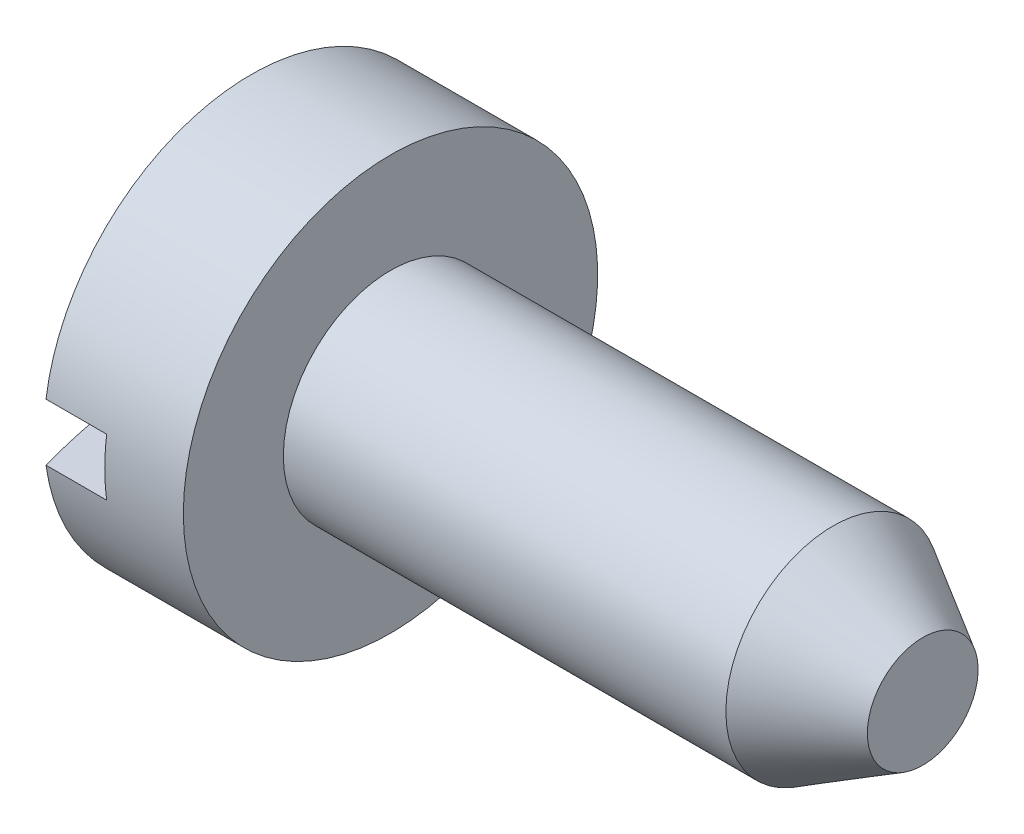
ISO-10303-21;
HEADER;
FILE_DESCRIPTION(('STEP AP214'),'2;1');
FILE_NAME('part.step','',(''),(''),'','','');
FILE_SCHEMA(('AUTOMOTIVE_DESIGN { 1 0 10303 214 1 1 1 1 }'));
ENDSEC;
DATA;
#1=APPLICATION_CONTEXT('core data for automotive mechanical design processes');
#2=APPLICATION_PROTOCOL_DEFINITION('international standard','automotive_design',2000,#1);
#3=PRODUCT_CONTEXT('',#1,'mechanical');
#4=PRODUCT('Part','Part','',(#3));
#5=PRODUCT_RELATED_PRODUCT_CATEGORY('part','',(#4));
#6=PRODUCT_DEFINITION_FORMATION('','',#4);
#7=PRODUCT_DEFINITION_CONTEXT('part definition',#1,'design');
#8=PRODUCT_DEFINITION('design','',#6,#7);
#9=PRODUCT_DEFINITION_SHAPE('','',#8);
#10=(LENGTH_UNIT() NAMED_UNIT(*) SI_UNIT(.MILLI.,.METRE.));
#11=(NAMED_UNIT(*) PLANE_ANGLE_UNIT() SI_UNIT($,.RADIAN.));
#12=(NAMED_UNIT(*) SI_UNIT($,.STERADIAN.) SOLID_ANGLE_UNIT());
#13=UNCERTAINTY_MEASURE_WITH_UNIT(LENGTH_MEASURE(1.E-05),#10,'distance_accuracy_value','');
#14=(GEOMETRIC_REPRESENTATION_CONTEXT(3) GLOBAL_UNCERTAINTY_ASSIGNED_CONTEXT((#13)) GLOBAL_UNIT_ASSIGNED_CONTEXT((#10,
#11,#12)) REPRESENTATION_CONTEXT('',''));
#15=CARTESIAN_POINT('',(0.,0.,0.));
#16=DIRECTION('',(0.,0.,1.));
#17=DIRECTION('',(1.,0.,0.));
#18=AXIS2_PLACEMENT_3D('',#15,#16,#17);
#19=CARTESIAN_POINT('',(0.,0.,0.));
#20=DIRECTION('',(-1.,0.,0.));
#21=DIRECTION('',(0.,0.,1.));
#22=AXIS2_PLACEMENT_3D('',#19,#20,#21);
#23=CYLINDRICAL_SURFACE('',#22,0.762);
#24=CARTESIAN_POINT('',(0.9906,0.,0.));
#25=DIRECTION('',(-1.,0.,0.));
#26=DIRECTION('',(0.,0.,1.));
#27=AXIS2_PLACEMENT_3D('',#24,#25,#26);
#28=CIRCLE('',#27,0.762);
#29=CARTESIAN_POINT('',(0.9906,0.,0.762));
#30=VERTEX_POINT('',#29);
#31=EDGE_CURVE('E138',#30,#30,#28,.T.);
#32=ORIENTED_EDGE('',*,*,#31,.F.);
#33=EDGE_LOOP('',(#32));
#34=FACE_BOUND('',#33,.T.);
#35=CARTESIAN_POINT('',(4.13728568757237,0.,0.));
#36=DIRECTION('',(-1.,0.,0.));
#37=DIRECTION('',(0.,0.,1.));
#38=AXIS2_PLACEMENT_3D('',#35,#36,#37);
#39=CIRCLE('',#38,0.762);
#40=CARTESIAN_POINT('',(4.13728568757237,0.,0.762));
#41=VERTEX_POINT('',#40);
#42=EDGE_CURVE('E189',#41,#41,#39,.T.);
#43=ORIENTED_EDGE('',*,*,#42,.T.);
#44=EDGE_LOOP('',(#43));
#45=FACE_BOUND('',#44,.T.);
#46=ADVANCED_FACE('F76',(#34,#45),#23,.T.);
#47=CARTESIAN_POINT('',(5.23874999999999,0.,0.));
#48=DIRECTION('',(-1.,0.,0.));
#49=DIRECTION('',(0.,1.,0.));
#50=AXIS2_PLACEMENT_3D('',#47,#48,#49);
#51=SPHERICAL_SURFACE('',#50,5.44194999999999);
#52=CARTESIAN_POINT('',(0.,0.,0.));
#53=DIRECTION('',(-1.,0.,0.));
#54=DIRECTION('',(0.,0.,1.));
#55=AXIS2_PLACEMENT_3D('',#52,#53,#54);
#56=CIRCLE('',#55,1.4732);
#57=CARTESIAN_POINT('',(0.,0.2032,1.45911891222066));
#58=VERTEX_POINT('',#57);
#59=CARTESIAN_POINT('',(0.,0.2032,-1.45911891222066));
#60=VERTEX_POINT('',#59);
#61=EDGE_CURVE('E152',#58,#60,#56,.T.);
#62=ORIENTED_EDGE('',*,*,#61,.T.);
#63=CARTESIAN_POINT('',(5.23874999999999,0.2032,0.));
#64=DIRECTION('',(0.,1.,0.));
#65=DIRECTION('',(0.,0.,1.));
#66=AXIS2_PLACEMENT_3D('',#63,#64,#65);
#67=CIRCLE('',#66,5.43815497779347);
#68=EDGE_CURVE('E99',#60,#58,#67,.T.);
#69=ORIENTED_EDGE('',*,*,#68,.T.);
#70=EDGE_LOOP('',(#62,#69));
#71=FACE_BOUND('',#70,.T.);
#72=ADVANCED_FACE('F157',(#71),#51,.T.);
#73=CARTESIAN_POINT('',(0.,-0.2032,-1.45911891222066));
#74=VERTEX_POINT('',#73);
#75=CARTESIAN_POINT('',(0.,-0.2032,1.45911891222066));
#76=VERTEX_POINT('',#75);
#77=EDGE_CURVE('E145',#74,#76,#56,.T.);
#78=ORIENTED_EDGE('',*,*,#77,.T.);
#79=CARTESIAN_POINT('',(5.23874999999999,-0.2032,0.));
#80=DIRECTION('',(0.,-1.,0.));
#81=DIRECTION('',(0.,0.,-1.));
#82=AXIS2_PLACEMENT_3D('',#79,#80,#81);
#83=CIRCLE('',#82,5.43815497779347);
#84=EDGE_CURVE('E118',#76,#74,#83,.T.);
#85=ORIENTED_EDGE('',*,*,#84,.T.);
#86=EDGE_LOOP('',(#78,#85));
#87=FACE_BOUND('',#86,.T.);
#88=ADVANCED_FACE('F78',(#87),#51,.T.);
#89=CARTESIAN_POINT('',(0.9906,0.762,0.));
#90=DIRECTION('',(-1.,0.,0.));
#91=DIRECTION('',(0.,0.,1.));
#92=AXIS2_PLACEMENT_3D('',#89,#90,#91);
#93=PLANE('',#92);
#94=CARTESIAN_POINT('',(0.9906,0.,0.));
#95=DIRECTION('',(-1.,0.,0.));
#96=DIRECTION('',(0.,0.,1.));
#97=AXIS2_PLACEMENT_3D('',#94,#95,#96);
#98=CIRCLE('',#97,1.4732);
#99=CARTESIAN_POINT('',(0.9906,0.,1.4732));
#100=VERTEX_POINT('',#99);
#101=EDGE_CURVE('E141',#100,#100,#98,.T.);
#102=ORIENTED_EDGE('',*,*,#101,.F.);
#103=EDGE_LOOP('',(#102));
#104=FACE_BOUND('',#103,.T.);
#105=ORIENTED_EDGE('',*,*,#31,.T.);
#106=EDGE_LOOP('',(#105));
#107=FACE_BOUND('',#106,.T.);
#108=ADVANCED_FACE('F166',(#104,#107),#93,.F.);
#109=CARTESIAN_POINT('',(0.,0.,0.));
#110=DIRECTION('',(-1.,0.,0.));
#111=DIRECTION('',(0.,0.,1.));
#112=AXIS2_PLACEMENT_3D('',#109,#110,#111);
#113=CYLINDRICAL_SURFACE('',#112,1.4732);
#114=CARTESIAN_POINT('',(0.4318,0.,0.));
#115=DIRECTION('',(1.,0.,0.));
#116=DIRECTION('',(0.,0.,-1.));
#117=AXIS2_PLACEMENT_3D('',#114,#115,#116);
#118=CIRCLE('',#117,1.4732);
#119=CARTESIAN_POINT('',(0.4318,-0.2032,-1.45911891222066));
#120=VERTEX_POINT('',#119);
#121=CARTESIAN_POINT('',(0.4318,0.2032,-1.45911891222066));
#122=VERTEX_POINT('',#121);
#123=EDGE_CURVE('E123',#120,#122,#118,.T.);
#124=ORIENTED_EDGE('',*,*,#123,.T.);
#125=DIRECTION('',(-1.,0.,0.));
#126=VECTOR('',#125,1.);
#127=CARTESIAN_POINT('',(0.,0.2032,-1.45911891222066));
#128=LINE('',#127,#126);
#129=EDGE_CURVE('E49',#122,#60,#128,.T.);
#130=ORIENTED_EDGE('',*,*,#129,.T.);
#131=ORIENTED_EDGE('',*,*,#61,.F.);
#132=DIRECTION('',(-1.,0.,0.));
#133=VECTOR('',#132,1.);
#134=CARTESIAN_POINT('',(0.,0.2032,1.45911891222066));
#135=LINE('',#134,#133);
#136=CARTESIAN_POINT('',(0.4318,0.2032,1.45911891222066));
#137=VERTEX_POINT('',#136);
#138=EDGE_CURVE('E84',#58,#137,#135,.F.);
#139=ORIENTED_EDGE('',*,*,#138,.T.);
#140=CARTESIAN_POINT('',(0.4318,-0.2032,1.45911891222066));
#141=VERTEX_POINT('',#140);
#142=EDGE_CURVE('E124',#137,#141,#118,.T.);
#143=ORIENTED_EDGE('',*,*,#142,.T.);
#144=DIRECTION('',(-1.,0.,0.));
#145=VECTOR('',#144,1.);
#146=CARTESIAN_POINT('',(0.,-0.2032,1.45911891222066));
#147=LINE('',#146,#145);
#148=EDGE_CURVE('E115',#141,#76,#147,.T.);
#149=ORIENTED_EDGE('',*,*,#148,.T.);
#150=ORIENTED_EDGE('',*,*,#77,.F.);
#151=DIRECTION('',(-1.,0.,0.));
#152=VECTOR('',#151,1.);
#153=CARTESIAN_POINT('',(0.,-0.2032,-1.45911891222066));
#154=LINE('',#153,#152);
#155=EDGE_CURVE('E143',#74,#120,#154,.F.);
#156=ORIENTED_EDGE('',*,*,#155,.T.);
#157=EDGE_LOOP('',(#124,#130,#131,#139,#143,#149,#150,#156));
#158=FACE_BOUND('',#157,.T.);
#159=ORIENTED_EDGE('',*,*,#101,.T.);
#160=EDGE_LOOP('',(#159));
#161=FACE_BOUND('',#160,.T.);
#162=ADVANCED_FACE('F135',(#158,#161),#113,.T.);
#163=CARTESIAN_POINT('',(-0.2032,0.2032,-1.4732));
#164=DIRECTION('',(0.,1.,0.));
#165=DIRECTION('',(0.,0.,1.));
#166=AXIS2_PLACEMENT_3D('',#163,#164,#165);
#167=PLANE('',#166);
#168=DIRECTION('',(0.,0.,1.));
#169=VECTOR('',#168,1.);
#170=CARTESIAN_POINT('',(0.4318,0.2032,-1.4732));
#171=LINE('',#170,#169);
#172=EDGE_CURVE('E131',#122,#137,#171,.T.);
#173=ORIENTED_EDGE('',*,*,#172,.T.);
#174=ORIENTED_EDGE('',*,*,#138,.F.);
#175=ORIENTED_EDGE('',*,*,#68,.F.);
#176=ORIENTED_EDGE('',*,*,#129,.F.);
#177=EDGE_LOOP('',(#173,#174,#175,#176));
#178=FACE_BOUND('',#177,.T.);
#179=ADVANCED_FACE('F158',(#178),#167,.F.);
#180=CARTESIAN_POINT('',(0.4318,0.2032,-1.4732));
#181=DIRECTION('',(1.,0.,0.));
#182=DIRECTION('',(0.,0.,-1.));
#183=AXIS2_PLACEMENT_3D('',#180,#181,#182);
#184=PLANE('',#183);
#185=ORIENTED_EDGE('',*,*,#172,.F.);
#186=ORIENTED_EDGE('',*,*,#123,.F.);
#187=DIRECTION('',(0.,0.,1.));
#188=VECTOR('',#187,1.);
#189=CARTESIAN_POINT('',(0.4318,-0.2032,-1.4732));
#190=LINE('',#189,#188);
#191=EDGE_CURVE('E91',#120,#141,#190,.T.);
#192=ORIENTED_EDGE('',*,*,#191,.T.);
#193=ORIENTED_EDGE('',*,*,#142,.F.);
#194=EDGE_LOOP('',(#185,#186,#192,#193));
#195=FACE_BOUND('',#194,.T.);
#196=ADVANCED_FACE('F128',(#195),#184,.F.);
#197=CARTESIAN_POINT('',(-0.2032,-0.2032,-1.4732));
#198=DIRECTION('',(0.,-1.,0.));
#199=DIRECTION('',(0.,0.,-1.));
#200=AXIS2_PLACEMENT_3D('',#197,#198,#199);
#201=PLANE('',#200);
#202=ORIENTED_EDGE('',*,*,#191,.F.);
#203=ORIENTED_EDGE('',*,*,#155,.F.);
#204=ORIENTED_EDGE('',*,*,#84,.F.);
#205=ORIENTED_EDGE('',*,*,#148,.F.);
#206=EDGE_LOOP('',(#202,#203,#204,#205));
#207=FACE_BOUND('',#206,.T.);
#208=ADVANCED_FACE('F116',(#207),#201,.F.);
#209=CARTESIAN_POINT('',(4.13728568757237,0.,0.));
#210=DIRECTION('',(-1.,0.,0.));
#211=DIRECTION('',(0.,0.,1.));
#212=AXIS2_PLACEMENT_3D('',#209,#210,#211);
#213=CONICAL_SURFACE('',#212,0.762,0.523598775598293);
#214=CARTESIAN_POINT('',(4.7752,0.,0.));
#215=DIRECTION('',(-1.,0.,0.));
#216=DIRECTION('',(0.,0.,1.));
#217=AXIS2_PLACEMENT_3D('',#214,#215,#216);
#218=CIRCLE('',#217,0.3937);
#219=CARTESIAN_POINT('',(4.7752,0.,0.3937));
#220=VERTEX_POINT('',#219);
#221=EDGE_CURVE('E132',#220,#220,#218,.T.);
#222=ORIENTED_EDGE('',*,*,#221,.T.);
#223=EDGE_LOOP('',(#222));
#224=FACE_BOUND('',#223,.T.);
#225=ORIENTED_EDGE('',*,*,#42,.F.);
#226=EDGE_LOOP('',(#225));
#227=FACE_BOUND('',#226,.T.);
#228=ADVANCED_FACE('F182',(#224,#227),#213,.T.);
#229=CARTESIAN_POINT('',(4.7752,0.762,0.));
#230=DIRECTION('',(-1.,0.,0.));
#231=DIRECTION('',(0.,0.,1.));
#232=AXIS2_PLACEMENT_3D('',#229,#230,#231);
#233=PLANE('',#232);
#234=ORIENTED_EDGE('',*,*,#221,.F.);
#235=EDGE_LOOP('',(#234));
#236=FACE_BOUND('',#235,.T.);
#237=ADVANCED_FACE('F180',(#236),#233,.F.);
#238=CLOSED_SHELL('',(#46,#72,#88,#108,#162,#179,#196,#208,#228,#237));
#239=MANIFOLD_SOLID_BREP('B6',#238);
#240=ADVANCED_BREP_SHAPE_REPRESENTATION('',(#18,#239),#14);
#241=SHAPE_DEFINITION_REPRESENTATION(#9,#240);
ENDSEC;
END-ISO-10303-21;
